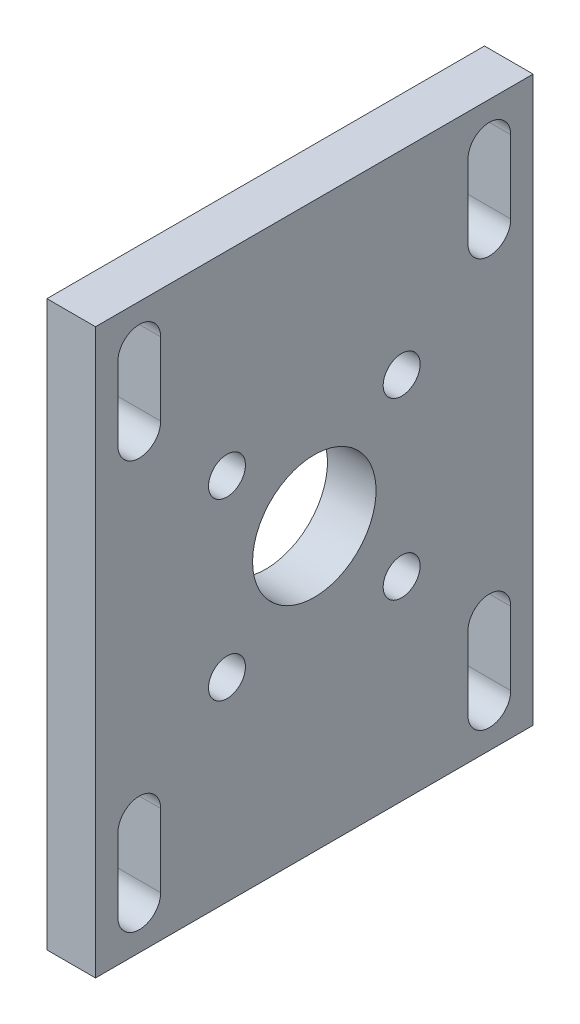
from build123d import *

# Parameters (mm, degrees)
SKETCH1_W                                         = 45
SKETCH1_H                                         = 58
BOSS_EXTRUDE1_DEPTH                               = 5
SKETCH2_R                                         = 6.35
CUT_EXTRUDE1_DEPTH                                = 38.043892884
CSK_FOR_6_FLAT_HEAD_SOCKET_CAP_SCREW1_D           = 3.7973
CSK_FOR_6_FLAT_HEAD_SOCKET_CAP_SCREW1_CSINK_D     = 7.7978
CSK_FOR_6_FLAT_HEAD_SOCKET_CAP_SCREW1_CSINK_ANGLE = 82
CUT_EXTRUDE2_DEPTH                                = 38.043892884
LPATTERN1_COUNT                                   = 2
LPATTERN1_PITCH                                   = 36
LPATTERN1_COUNT_DIR2                              = 2
LPATTERN1_PITCH_DIR2                              = 42


with BuildPart() as part:
    # Sketch1 → Boss-Extrude1 (new body)
    with BuildSketch(Plane(origin=(0, 0, 0), x_dir=(0, 0, -1), z_dir=(1, 0, 0))):
        Rectangle(SKETCH1_W, SKETCH1_H)
    extrude(amount=BOSS_EXTRUDE1_DEPTH)

    # Sketch2 → Cut-Extrude1 (cut, through all)
    with BuildSketch(Plane.ZY):
        Circle(SKETCH2_R)
    extrude(amount=-CUT_EXTRUDE1_DEPTH, mode=Mode.SUBTRACT)

    # CSK for _6 Flat Head Socket Cap Screw1 (through all)
    with Locations(Plane.ZY):
        with Locations((-8.980256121, 8.980256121), (8.980256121, 8.980256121), (8.980256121, -8.980256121), (-8.980256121, -8.980256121)):
            CounterSinkHole(CSK_FOR_6_FLAT_HEAD_SOCKET_CAP_SCREW1_D / 2, CSK_FOR_6_FLAT_HEAD_SOCKET_CAP_SCREW1_CSINK_D / 2, counter_sink_angle=CSK_FOR_6_FLAT_HEAD_SOCKET_CAP_SCREW1_CSINK_ANGLE)

    # Sketch8 → Cut-Extrude2 (cut, through all)
    with BuildSketch(Plane.ZY):
        with BuildLine():
            Line((-20.2, -24.75), (-20.2, -17.25))
            ThreePointArc((-20.2, -17.25), (-18, -15.05), (-15.8, -17.25))
            Line((-15.8, -17.25), (-15.8, -24.75))
            ThreePointArc((-15.8, -24.75), (-18, -26.95), (-20.2, -24.75))
        make_face()
    cut_extrude2 = extrude(amount=-CUT_EXTRUDE2_DEPTH, mode=Mode.SUBTRACT)

    # LPattern1: Cut-Extrude2 2 × 2
    with Locations(*[(0, j * LPATTERN1_PITCH_DIR2, i * LPATTERN1_PITCH) for i in range(LPATTERN1_COUNT) for j in range(LPATTERN1_COUNT_DIR2) if (i, j) != (0, 0)]):
        add(cut_extrude2, mode=Mode.SUBTRACT)


solid = part.part
